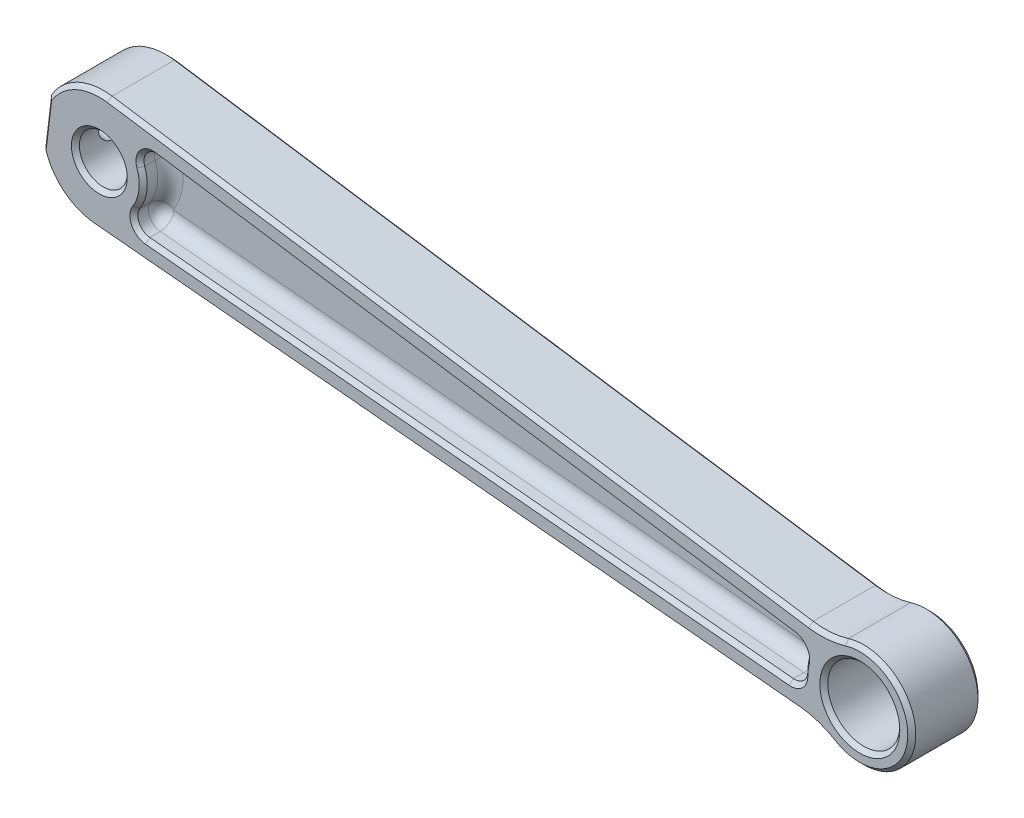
from build123d import *

# Parameters (mm, degrees)
SKETCH6_R                       = 3
BOSS_EXTRUDE1_DEPTH             = 8.8
BOSS_EXTRUDE2_DEPTH             = 8.8
FILLET2_R                       = 10
M3X0_5_TAPPED_HOLE1_D           = 2.5
M3X0_5_TAPPED_HOLE1_DEPTH       = 8.5
M3X0_5_TAPPED_HOLE1_CBORE_D     = 3
M3X0_5_TAPPED_HOLE1_CBORE_DEPTH = 6.5
M3X0_5_TAPPED_HOLE1_TIP         = 0.751075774
CUT_EXTRUDE1_START              = -1
CUT_EXTRUDE1_DEPTH              = 135.320477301
FILLET3_R                       = 1.5875
CHAMFER1_SIZE                   = 0.5


with BuildPart() as part:
    # Sketch6 → Boss-Extrude1 (new body)
    with BuildSketch(Plane.XY.offset(21)):
        with BuildLine():
            Line((4.339214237, -53.038321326), (3.618042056, -58.994822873))
            ThreePointArc((3.618042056, -58.994822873), (18.248284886, -57.744243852), (4.339214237, -53.038321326))
        make_face()
        with Locations((10.802657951, -56.842778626)):
            Circle(SKETCH6_R, mode=Mode.SUBTRACT)
    extrude(amount=BOSS_EXTRUDE1_DEPTH)



with BuildPart() as body_2:
    # Sketch7 → Revolve1 (revolve)
    with BuildSketch(Plane(origin=(87.190361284, 18.897173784, 0), x_dir=(0.2118168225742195, -0.9773093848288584, 0), z_dir=(-0.9773093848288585, -0.2118168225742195, 0)), mode=Mode.PRIVATE) as revolve1_sk:
        Polygon((82.792394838, 29.8), (84.792394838, 29.8), (84.792394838, 21.8), (85.592394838, 21.8), (85.592394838, 21), (82.792394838, 21), align=None)
    revolve(revolve1_sk.sketch.rotate(Axis((106.106682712, -68.381533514, 32.3), (0, 0, -1)), 192.228843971), axis=Axis((106.106682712, -68.381533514, 32.3), (0, 0, -1)))


with BuildPart() as part_1:
    add(part.part)

    add(body_2.part)  # Boss-Extrude2 merges body 2
    # Sketch8 → Boss-Extrude2 (add)
    with BuildSketch(Plane.XY.offset(21)):
        with BuildLine():
            Line((11.906492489, -49.42445339), (102.567183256, -62.914614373))
            ThreePointArc((102.567183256, -62.914614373), (99.641198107, -67.598737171), (101.364783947, -72.845797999))
            Line((101.364783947, -72.845797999), (10.104230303, -64.310187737))
            ThreePointArc((10.104230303, -64.310187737), (18.248284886, -57.744243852), (11.906492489, -49.42445339))
        make_face()
    extrude(amount=BOSS_EXTRUDE2_DEPTH)

    # Fillet2
    fillet2_edges = [part_1.edges().sort_by_distance(p)[0] for p in [
        (101.364783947, -72.845797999, 25.4),
        (102.567183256, -62.914614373, 25.4),
    ]]
    fillet(fillet2_edges, radius=FILLET2_R)

    # M3x0.5 Tapped Hole1
    with Locations(Plane(origin=(10.605269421, -1.284012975, 0), x_dir=(0, 0, 1), z_dir=(-0.9927502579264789, 0.1201953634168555, 0))):
        with Locations((25.4, -55.132253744)):
            CounterBoreHole(M3X0_5_TAPPED_HOLE1_D / 2, M3X0_5_TAPPED_HOLE1_CBORE_D / 2, M3X0_5_TAPPED_HOLE1_CBORE_DEPTH, depth=M3X0_5_TAPPED_HOLE1_DEPTH)
            with Locations((0, 0, -(M3X0_5_TAPPED_HOLE1_DEPTH + M3X0_5_TAPPED_HOLE1_TIP / 2))):  # 118° drill point
                Cone(0, M3X0_5_TAPPED_HOLE1_D / 2, M3X0_5_TAPPED_HOLE1_TIP, mode=Mode.SUBTRACT)

    # Sketch16 → Cut-Extrude1 (cut, through all)
    with BuildSketch(Plane.XY.offset(25.4).offset(CUT_EXTRUDE1_START)):
        with BuildLine():
            Line((97.92057114, -64.750730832), (17.786404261, -52.82689921))
            ThreePointArc((17.786404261, -52.82689921), (16.2702686, -53.409536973), (15.987967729, -55.0090495))
            ThreePointArc((15.987967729, -55.0090495), (16.26278437, -57.503853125), (15.400528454, -59.860987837))
            ThreePointArc((15.400528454, -59.860987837), (15.29295217, -61.481654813), (16.626235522, -62.409280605))
            Line((16.626235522, -62.409280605), (97.290615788, -69.953829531))
            ThreePointArc((97.290615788, -69.953829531), (98.55036846, -69.53535483), (99.094215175, -68.324434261))
            ThreePointArc((99.094215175, -68.324434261), (99.144822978, -67.538639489), (99.283205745, -66.763471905))
            ThreePointArc((99.283205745, -66.763471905), (99.044056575, -65.457751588), (97.92057114, -64.750730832))
        make_face()
    cut_extrude1 = extrude(amount=-CUT_EXTRUDE1_DEPTH, mode=Mode.SUBTRACT)

    # Mirror1: Cut-Extrude1 across plane
    add(cut_extrude1.mirror(Plane.XY.offset(25.4)), mode=Mode.SUBTRACT)

    # Fillet3
    fillet3_edges = [part_1.edges().sort_by_distance(p)[0] for p in [
        (16.2702686, -53.409536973, 24.4),
        (16.26278437, -57.503853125, 24.4),
        (15.29295217, -61.481654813, 24.4),
        (56.958425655, -66.181555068, 24.4),
        (98.55036846, -69.53535483, 24.4),
        (99.144822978, -67.538639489, 24.4),
        (99.044056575, -65.457751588, 24.4),
        (57.8534877, -58.788815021, 24.4),
        (16.2702686, -53.409536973, 26.4),
        (16.26278437, -57.503853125, 26.4),
        (15.29295217, -61.481654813, 26.4),
        (56.958425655, -66.181555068, 26.4),
        (98.55036846, -69.53535483, 26.4),
        (99.144822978, -67.538639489, 26.4),
        (99.044056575, -65.457751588, 26.4),
        (57.8534877, -58.788815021, 26.4),
    ]]
    fillet(fillet3_edges, radius=FILLET3_R)

    # Chamfer1
    chamfer1_edges = [part_1.edges().sort_by_distance(p)[0] for p in [
        (7.570574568, -50.074940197, 21),
        (7.570574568, -50.074940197, 29.8),
        (54.320544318, -68.445744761, 21),
        (54.320544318, -68.445744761, 29.8),
        (106.106682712, -63.868833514, 29.8),
        (3.978628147, -56.0165721, 21),
        (112.572167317, -69.164329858, 21),
        (6.048831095, -62.643738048, 21),
        (112.572167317, -69.164329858, 29.8),
        (55.832169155, -55.960521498, 21),
        (55.832169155, -55.960521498, 29.8),
        (100.723061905, -73.036186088, 21),
        (100.723061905, -73.036186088, 29.8),
        (101.989438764, -62.576581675, 21),
        (101.989438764, -62.576581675, 29.8),
        (6.048831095, -62.643738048, 29.8),
        (16.2702686, -53.409536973, 21),
        (57.8534877, -58.788815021, 21),
        (99.044056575, -65.457751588, 21),
        (99.144822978, -67.538639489, 21),
        (98.55036846, -69.53535483, 21),
        (56.958425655, -66.181555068, 21),
        (15.29295217, -61.481654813, 21),
        (16.26278437, -57.503853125, 21),
        (3.978628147, -56.0165721, 29.8),
        (7.802657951, -56.842778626, 21),
        (7.802657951, -56.842778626, 29.8),
        (16.2702686, -53.409536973, 29.8),
        (16.26278437, -57.503853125, 29.8),
        (15.29295217, -61.481654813, 29.8),
        (56.958425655, -66.181555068, 29.8),
        (98.55036846, -69.53535483, 29.8),
        (99.144822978, -67.538639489, 29.8),
        (99.044056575, -65.457751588, 29.8),
        (57.8534877, -58.788815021, 29.8),
    ]]
    chamfer(chamfer1_edges, length=CHAMFER1_SIZE)


solid = part_1.part
